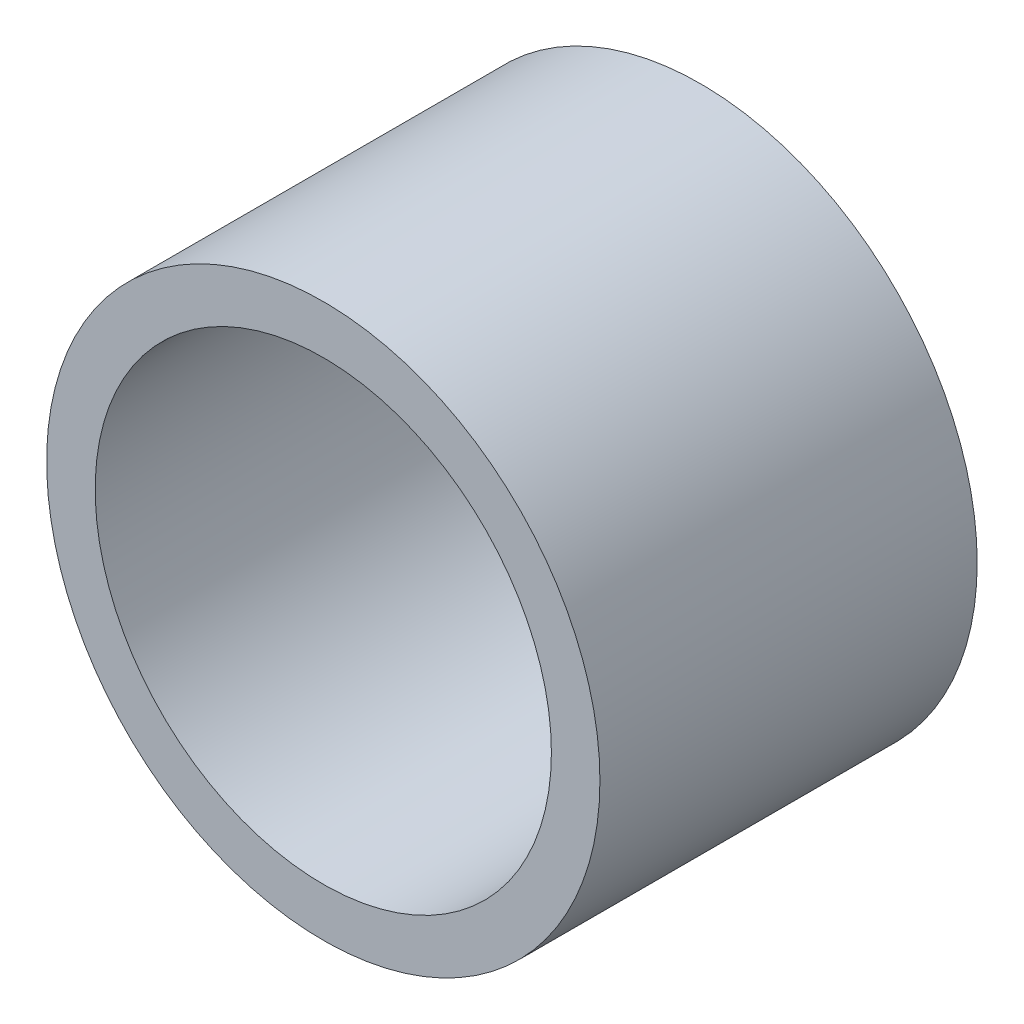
ISO-10303-21;
HEADER;
FILE_DESCRIPTION(('STEP AP214'),'2;1');
FILE_NAME('part.step','',(''),(''),'','','');
FILE_SCHEMA(('AUTOMOTIVE_DESIGN { 1 0 10303 214 1 1 1 1 }'));
ENDSEC;
DATA;
#1=APPLICATION_CONTEXT('core data for automotive mechanical design processes');
#2=APPLICATION_PROTOCOL_DEFINITION('international standard','automotive_design',2000,#1);
#3=PRODUCT_CONTEXT('',#1,'mechanical');
#4=PRODUCT('Part','Part','',(#3));
#5=PRODUCT_RELATED_PRODUCT_CATEGORY('part','',(#4));
#6=PRODUCT_DEFINITION_FORMATION('','',#4);
#7=PRODUCT_DEFINITION_CONTEXT('part definition',#1,'design');
#8=PRODUCT_DEFINITION('design','',#6,#7);
#9=PRODUCT_DEFINITION_SHAPE('','',#8);
#10=(LENGTH_UNIT() NAMED_UNIT(*) SI_UNIT(.MILLI.,.METRE.));
#11=(NAMED_UNIT(*) PLANE_ANGLE_UNIT() SI_UNIT($,.RADIAN.));
#12=(NAMED_UNIT(*) SI_UNIT($,.STERADIAN.) SOLID_ANGLE_UNIT());
#13=UNCERTAINTY_MEASURE_WITH_UNIT(LENGTH_MEASURE(1.E-05),#10,'distance_accuracy_value','');
#14=(GEOMETRIC_REPRESENTATION_CONTEXT(3) GLOBAL_UNCERTAINTY_ASSIGNED_CONTEXT((#13)) GLOBAL_UNIT_ASSIGNED_CONTEXT((#10,
#11,#12)) REPRESENTATION_CONTEXT('',''));
#15=CARTESIAN_POINT('',(0.,0.,0.));
#16=DIRECTION('',(0.,0.,1.));
#17=DIRECTION('',(1.,0.,0.));
#18=AXIS2_PLACEMENT_3D('',#15,#16,#17);
#19=CARTESIAN_POINT('',(0.,0.,15.));
#20=DIRECTION('',(0.,0.,1.));
#21=DIRECTION('',(1.,0.,0.));
#22=AXIS2_PLACEMENT_3D('',#19,#20,#21);
#23=PLANE('',#22);
#24=CARTESIAN_POINT('',(0.,0.,15.));
#25=DIRECTION('',(0.,0.,1.));
#26=DIRECTION('',(1.,0.,0.));
#27=AXIS2_PLACEMENT_3D('',#24,#25,#26);
#28=CIRCLE('',#27,11.);
#29=CARTESIAN_POINT('',(11.,0.,15.));
#30=VERTEX_POINT('',#29);
#31=EDGE_CURVE('E10',#30,#30,#28,.T.);
#32=ORIENTED_EDGE('',*,*,#31,.T.);
#33=EDGE_LOOP('',(#32));
#34=FACE_BOUND('',#33,.T.);
#35=CARTESIAN_POINT('',(0.,0.,15.));
#36=DIRECTION('',(0.,0.,1.));
#37=DIRECTION('',(1.,0.,0.));
#38=AXIS2_PLACEMENT_3D('',#35,#36,#37);
#39=CIRCLE('',#38,9.07);
#40=CARTESIAN_POINT('',(9.07,0.,15.));
#41=VERTEX_POINT('',#40);
#42=EDGE_CURVE('E42',#41,#41,#39,.T.);
#43=ORIENTED_EDGE('',*,*,#42,.F.);
#44=EDGE_LOOP('',(#43));
#45=FACE_BOUND('',#44,.T.);
#46=ADVANCED_FACE('F31',(#34,#45),#23,.T.);
#47=CARTESIAN_POINT('',(0.,0.,0.));
#48=DIRECTION('',(0.,0.,1.));
#49=DIRECTION('',(1.,0.,0.));
#50=AXIS2_PLACEMENT_3D('',#47,#48,#49);
#51=PLANE('',#50);
#52=CARTESIAN_POINT('',(0.,0.,0.));
#53=DIRECTION('',(0.,0.,1.));
#54=DIRECTION('',(1.,0.,0.));
#55=AXIS2_PLACEMENT_3D('',#52,#53,#54);
#56=CIRCLE('',#55,11.);
#57=CARTESIAN_POINT('',(11.,0.,0.));
#58=VERTEX_POINT('',#57);
#59=EDGE_CURVE('E35',#58,#58,#56,.T.);
#60=ORIENTED_EDGE('',*,*,#59,.F.);
#61=EDGE_LOOP('',(#60));
#62=FACE_BOUND('',#61,.T.);
#63=CARTESIAN_POINT('',(0.,0.,0.));
#64=DIRECTION('',(0.,0.,1.));
#65=DIRECTION('',(1.,0.,0.));
#66=AXIS2_PLACEMENT_3D('',#63,#64,#65);
#67=CIRCLE('',#66,9.07);
#68=CARTESIAN_POINT('',(9.07,0.,0.));
#69=VERTEX_POINT('',#68);
#70=EDGE_CURVE('E44',#69,#69,#67,.T.);
#71=ORIENTED_EDGE('',*,*,#70,.T.);
#72=EDGE_LOOP('',(#71));
#73=FACE_BOUND('',#72,.T.);
#74=ADVANCED_FACE('F54',(#62,#73),#51,.F.);
#75=CARTESIAN_POINT('',(0.,0.,15.));
#76=DIRECTION('',(0.,0.,-1.));
#77=DIRECTION('',(-1.,0.,0.));
#78=AXIS2_PLACEMENT_3D('',#75,#76,#77);
#79=CYLINDRICAL_SURFACE('',#78,11.);
#80=ORIENTED_EDGE('',*,*,#31,.F.);
#81=EDGE_LOOP('',(#80));
#82=FACE_BOUND('',#81,.T.);
#83=ORIENTED_EDGE('',*,*,#59,.T.);
#84=EDGE_LOOP('',(#83));
#85=FACE_BOUND('',#84,.T.);
#86=ADVANCED_FACE('F33',(#82,#85),#79,.T.);
#87=CARTESIAN_POINT('',(0.,0.,15.));
#88=DIRECTION('',(0.,0.,-1.));
#89=DIRECTION('',(-1.,0.,0.));
#90=AXIS2_PLACEMENT_3D('',#87,#88,#89);
#91=CYLINDRICAL_SURFACE('',#90,9.07);
#92=ORIENTED_EDGE('',*,*,#42,.T.);
#93=EDGE_LOOP('',(#92));
#94=FACE_BOUND('',#93,.T.);
#95=ORIENTED_EDGE('',*,*,#70,.F.);
#96=EDGE_LOOP('',(#95));
#97=FACE_BOUND('',#96,.T.);
#98=ADVANCED_FACE('F50',(#94,#97),#91,.F.);
#99=CLOSED_SHELL('',(#46,#74,#86,#98));
#100=MANIFOLD_SOLID_BREP('B2',#99);
#101=ADVANCED_BREP_SHAPE_REPRESENTATION('',(#18,#100),#14);
#102=SHAPE_DEFINITION_REPRESENTATION(#9,#101);
ENDSEC;
END-ISO-10303-21;
